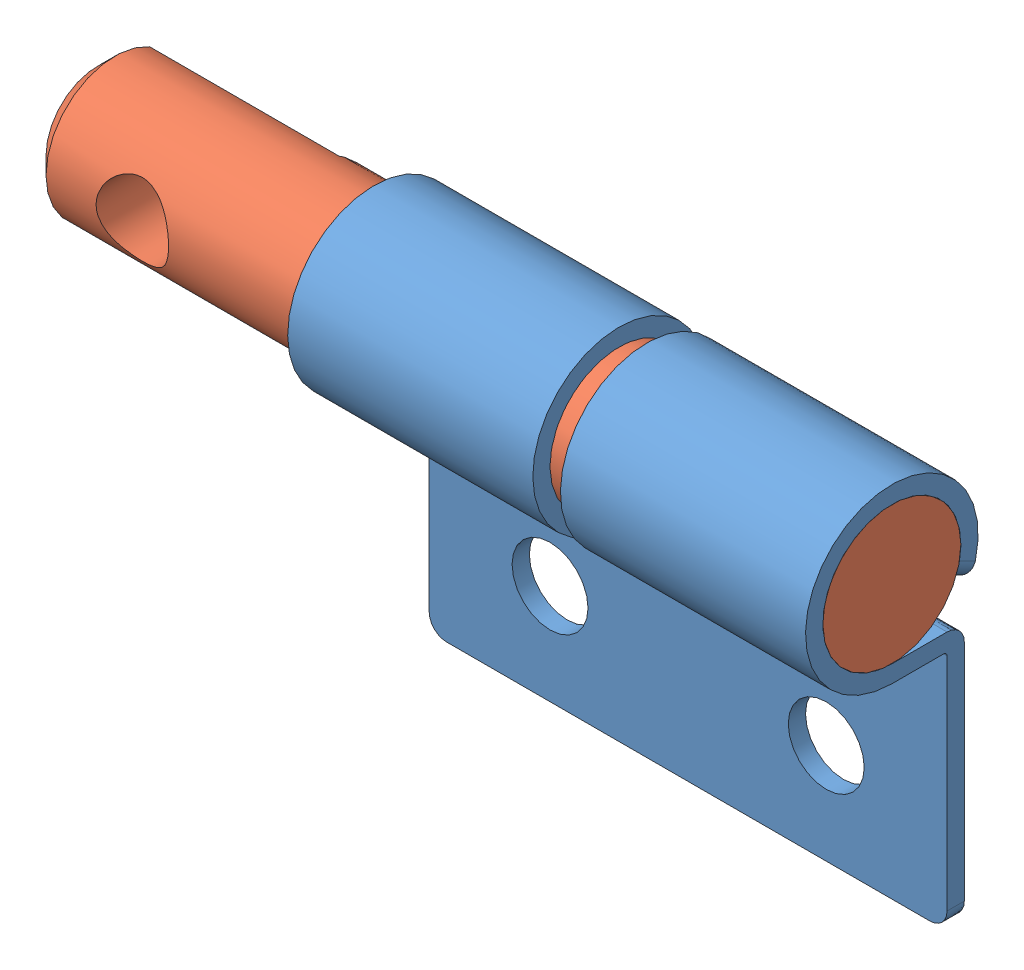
SolidWorks assembly ST015A1.SLDASM, configuration Default (file format 7000). Lengths in mm.
Overall size (23.03 12 5).
2 component instances, 2 part files, 3 mates.
Components (placement in the parent):
- ST015A BRACKET-1: ST015A BRACKET.SLDPRT [Default] at (7.5 0 0) size (15.03 12 5)
- ST015A1 Shaft-2: ST015A1 Shaft.SLDPRT [ST025] at (15 0 0) x (-1 0 0) z (0 0 -1) size (23 4 4)
Mates (geometry in assembly coordinates):
- Coincident1: coincident aligned: plane of ST015A BRACKET-1 through (15 -2.5 -1.6) normal (1 0 0); plane of ST015A1 Shaft-2 through (15 0 0) normal (1 0 0)
- Concentric1: concentric anti-aligned: cylinder of ST015A BRACKET-1 through (15 0 0) axis (-1 0 0) radius 2; cylinder of ST015A1 Shaft-2 through (15 0 0) axis (1 0 0) radius 2
- Parallel1: parallel aligned: plane of ST015A BRACKET-1 through (15 -2.5 -2.1) normal (0 0 -1); plane of ST015A1 Shaft-2 through (-2 1.7321 -1) normal (0 0 -1)
